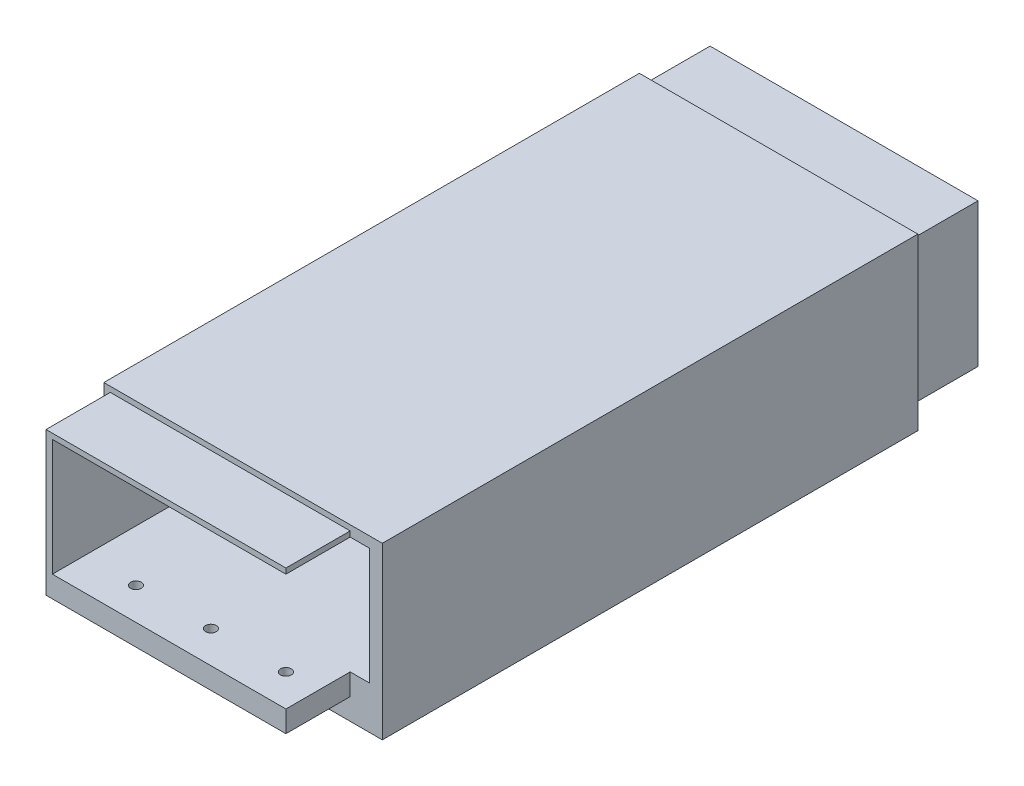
ISO-10303-21;
HEADER;
FILE_DESCRIPTION(('STEP AP214'),'2;1');
FILE_NAME('part.step','',(''),(''),'','','');
FILE_SCHEMA(('AUTOMOTIVE_DESIGN { 1 0 10303 214 1 1 1 1 }'));
ENDSEC;
DATA;
#1=APPLICATION_CONTEXT('core data for automotive mechanical design processes');
#2=APPLICATION_PROTOCOL_DEFINITION('international standard','automotive_design',2000,#1);
#3=PRODUCT_CONTEXT('',#1,'mechanical');
#4=PRODUCT('Part','Part','',(#3));
#5=PRODUCT_RELATED_PRODUCT_CATEGORY('part','',(#4));
#6=PRODUCT_DEFINITION_FORMATION('','',#4);
#7=PRODUCT_DEFINITION_CONTEXT('part definition',#1,'design');
#8=PRODUCT_DEFINITION('design','',#6,#7);
#9=PRODUCT_DEFINITION_SHAPE('','',#8);
#10=(LENGTH_UNIT() NAMED_UNIT(*) SI_UNIT(.MILLI.,.METRE.));
#11=(NAMED_UNIT(*) PLANE_ANGLE_UNIT() SI_UNIT($,.RADIAN.));
#12=(NAMED_UNIT(*) SI_UNIT($,.STERADIAN.) SOLID_ANGLE_UNIT());
#13=UNCERTAINTY_MEASURE_WITH_UNIT(LENGTH_MEASURE(1.E-05),#10,'distance_accuracy_value','');
#14=(GEOMETRIC_REPRESENTATION_CONTEXT(3) GLOBAL_UNCERTAINTY_ASSIGNED_CONTEXT((#13)) GLOBAL_UNIT_ASSIGNED_CONTEXT((#10,
#11,#12)) REPRESENTATION_CONTEXT('',''));
#15=CARTESIAN_POINT('',(0.,0.,0.));
#16=DIRECTION('',(0.,0.,1.));
#17=DIRECTION('',(1.,0.,0.));
#18=AXIS2_PLACEMENT_3D('',#15,#16,#17);
#19=CARTESIAN_POINT('',(0.,0.,1670.00000000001));
#20=DIRECTION('',(0.,0.,-1.));
#21=DIRECTION('',(-1.,0.,0.));
#22=AXIS2_PLACEMENT_3D('',#19,#20,#21);
#23=PLANE('',#22);
#24=DIRECTION('',(0.,1.,0.));
#25=VECTOR('',#24,1.);
#26=CARTESIAN_POINT('',(-7.30239365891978,142.51739571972,1670.00000000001));
#27=LINE('',#26,#25);
#28=CARTESIAN_POINT('',(-7.30239365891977,73.0246653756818,1670.00000000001));
#29=VERTEX_POINT('',#28);
#30=CARTESIAN_POINT('',(-7.30239365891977,83.0246653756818,1670.00000000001));
#31=VERTEX_POINT('',#30);
#32=EDGE_CURVE('E167',#29,#31,#27,.T.);
#33=ORIENTED_EDGE('',*,*,#32,.F.);
#34=DIRECTION('',(1.,0.,0.));
#35=VECTOR('',#34,1.);
#36=CARTESIAN_POINT('',(-119.30239365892,73.0246653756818,1670.00000000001));
#37=LINE('',#36,#35);
#38=CARTESIAN_POINT('',(-119.30239365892,73.0246653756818,1670.00000000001));
#39=VERTEX_POINT('',#38);
#40=EDGE_CURVE('E178',#39,#29,#37,.T.);
#41=ORIENTED_EDGE('',*,*,#40,.F.);
#42=DIRECTION('',(0.,-1.,0.));
#43=VECTOR('',#42,1.);
#44=CARTESIAN_POINT('',(-119.30239365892,140.01739571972,1670.00000000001));
#45=LINE('',#44,#43);
#46=CARTESIAN_POINT('',(-119.30239365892,140.01739571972,1670.00000000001));
#47=VERTEX_POINT('',#46);
#48=EDGE_CURVE('E188',#47,#39,#45,.T.);
#49=ORIENTED_EDGE('',*,*,#48,.F.);
#50=DIRECTION('',(-1.,0.,0.));
#51=VECTOR('',#50,1.);
#52=CARTESIAN_POINT('',(-119.30239365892,140.01739571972,1670.00000000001));
#53=LINE('',#52,#51);
#54=CARTESIAN_POINT('',(-7.30239365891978,140.01739571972,1670.00000000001));
#55=VERTEX_POINT('',#54);
#56=EDGE_CURVE('E60',#55,#47,#53,.T.);
#57=ORIENTED_EDGE('',*,*,#56,.F.);
#58=CARTESIAN_POINT('',(-7.30239365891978,137.51739571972,1670.00000000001));
#59=VERTEX_POINT('',#58);
#60=EDGE_CURVE('E54',#59,#55,#27,.T.);
#61=ORIENTED_EDGE('',*,*,#60,.F.);
#62=DIRECTION('',(1.,0.,0.));
#63=VECTOR('',#62,1.);
#64=CARTESIAN_POINT('',(-116.30239365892,137.51739571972,1670.00000000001));
#65=LINE('',#64,#63);
#66=CARTESIAN_POINT('',(1.6976063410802,137.51739571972,1670.00000000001));
#67=VERTEX_POINT('',#66);
#68=EDGE_CURVE('E407',#59,#67,#65,.T.);
#69=ORIENTED_EDGE('',*,*,#68,.T.);
#70=DIRECTION('',(0.,-1.,0.));
#71=VECTOR('',#70,1.);
#72=CARTESIAN_POINT('',(1.6976063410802,137.51739571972,1670.00000000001));
#73=LINE('',#72,#71);
#74=CARTESIAN_POINT('',(1.69760634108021,83.0246653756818,1670.00000000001));
#75=VERTEX_POINT('',#74);
#76=EDGE_CURVE('E413',#67,#75,#73,.T.);
#77=ORIENTED_EDGE('',*,*,#76,.T.);
#78=DIRECTION('',(-1.,0.,0.));
#79=VECTOR('',#78,1.);
#80=CARTESIAN_POINT('',(-116.30239365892,83.0246653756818,1670.00000000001));
#81=LINE('',#80,#79);
#82=EDGE_CURVE('E181',#75,#31,#81,.T.);
#83=ORIENTED_EDGE('',*,*,#82,.T.);
#84=EDGE_LOOP('',(#33,#41,#49,#57,#61,#69,#77,#83));
#85=FACE_BOUND('',#84,.T.);
#86=DIRECTION('',(1.,0.,0.));
#87=VECTOR('',#86,1.);
#88=CARTESIAN_POINT('',(-122.30239365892,63.0246653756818,1670.00000000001));
#89=LINE('',#88,#87);
#90=CARTESIAN_POINT('',(-122.30239365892,63.0246653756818,1670.00000000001));
#91=VERTEX_POINT('',#90);
#92=CARTESIAN_POINT('',(7.69760634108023,63.0246653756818,1670.00000000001));
#93=VERTEX_POINT('',#92);
#94=EDGE_CURVE('E205',#91,#93,#89,.T.);
#95=ORIENTED_EDGE('',*,*,#94,.T.);
#96=DIRECTION('',(0.,1.,0.));
#97=VECTOR('',#96,1.);
#98=CARTESIAN_POINT('',(7.69760634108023,63.0246653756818,1670.00000000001));
#99=LINE('',#98,#97);
#100=CARTESIAN_POINT('',(7.69760634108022,142.51739571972,1670.00000000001));
#101=VERTEX_POINT('',#100);
#102=EDGE_CURVE('E208',#93,#101,#99,.T.);
#103=ORIENTED_EDGE('',*,*,#102,.T.);
#104=DIRECTION('',(-1.,0.,0.));
#105=VECTOR('',#104,1.);
#106=CARTESIAN_POINT('',(-122.30239365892,142.51739571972,1670.00000000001));
#107=LINE('',#106,#105);
#108=CARTESIAN_POINT('',(-122.30239365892,142.51739571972,1670.00000000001));
#109=VERTEX_POINT('',#108);
#110=EDGE_CURVE('E210',#101,#109,#107,.T.);
#111=ORIENTED_EDGE('',*,*,#110,.T.);
#112=DIRECTION('',(0.,-1.,0.));
#113=VECTOR('',#112,1.);
#114=CARTESIAN_POINT('',(-122.30239365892,63.0246653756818,1670.00000000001));
#115=LINE('',#114,#113);
#116=EDGE_CURVE('E202',#109,#91,#115,.T.);
#117=ORIENTED_EDGE('',*,*,#116,.T.);
#118=EDGE_LOOP('',(#95,#103,#111,#117));
#119=FACE_BOUND('',#118,.T.);
#120=ADVANCED_FACE('F39',(#85,#119),#23,.F.);
#121=CARTESIAN_POINT('',(-119.30239365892,140.01739571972,1561.88680099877));
#122=DIRECTION('',(0.,-1.,0.));
#123=DIRECTION('',(0.,0.,-1.));
#124=AXIS2_PLACEMENT_3D('',#121,#122,#123);
#125=PLANE('',#124);
#126=DIRECTION('',(-1.,0.,0.));
#127=VECTOR('',#126,1.);
#128=CARTESIAN_POINT('',(-119.30239365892,140.01739571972,1420.00000000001));
#129=LINE('',#128,#127);
#130=CARTESIAN_POINT('',(5.77293715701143,140.01739571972,1420.00000000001));
#131=VERTEX_POINT('',#130);
#132=CARTESIAN_POINT('',(-119.30239365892,140.01739571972,1420.00000000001));
#133=VERTEX_POINT('',#132);
#134=EDGE_CURVE('E231',#131,#133,#129,.T.);
#135=ORIENTED_EDGE('',*,*,#134,.F.);
#136=DIRECTION('',(0.,0.,-1.));
#137=VECTOR('',#136,1.);
#138=CARTESIAN_POINT('',(5.77293715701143,140.01739571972,1561.88680099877));
#139=LINE('',#138,#137);
#140=CARTESIAN_POINT('',(5.77293715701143,140.01739571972,1390.00000000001));
#141=VERTEX_POINT('',#140);
#142=EDGE_CURVE('E277',#131,#141,#139,.T.);
#143=ORIENTED_EDGE('',*,*,#142,.T.);
#144=DIRECTION('',(-1.,0.,0.));
#145=VECTOR('',#144,1.);
#146=CARTESIAN_POINT('',(-119.30239365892,140.01739571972,1390.00000000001));
#147=LINE('',#146,#145);
#148=CARTESIAN_POINT('',(-119.30239365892,140.01739571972,1390.00000000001));
#149=VERTEX_POINT('',#148);
#150=EDGE_CURVE('E272',#141,#149,#147,.T.);
#151=ORIENTED_EDGE('',*,*,#150,.T.);
#152=DIRECTION('',(0.,0.,-1.));
#153=VECTOR('',#152,1.);
#154=CARTESIAN_POINT('',(-119.30239365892,140.01739571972,1561.88680099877));
#155=LINE('',#154,#153);
#156=EDGE_CURVE('E275',#133,#149,#155,.T.);
#157=ORIENTED_EDGE('',*,*,#156,.F.);
#158=EDGE_LOOP('',(#135,#143,#151,#157));
#159=FACE_BOUND('',#158,.T.);
#160=ADVANCED_FACE('F294',(#159),#125,.F.);
#161=CARTESIAN_POINT('',(5.77293715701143,140.01739571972,1561.88680099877));
#162=DIRECTION('',(-1.,0.,0.));
#163=DIRECTION('',(0.,-1.,0.));
#164=AXIS2_PLACEMENT_3D('',#161,#162,#163);
#165=PLANE('',#164);
#166=DIRECTION('',(0.,1.,0.));
#167=VECTOR('',#166,1.);
#168=CARTESIAN_POINT('',(5.77293715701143,140.01739571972,1420.00000000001));
#169=LINE('',#168,#167);
#170=CARTESIAN_POINT('',(5.77293715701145,73.0246653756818,1420.00000000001));
#171=VERTEX_POINT('',#170);
#172=EDGE_CURVE('E234',#171,#131,#169,.T.);
#173=ORIENTED_EDGE('',*,*,#172,.F.);
#174=DIRECTION('',(0.,0.,-1.));
#175=VECTOR('',#174,1.);
#176=CARTESIAN_POINT('',(5.77293715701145,73.0246653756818,1561.88680099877));
#177=LINE('',#176,#175);
#178=CARTESIAN_POINT('',(5.77293715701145,73.0246653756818,1390.00000000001));
#179=VERTEX_POINT('',#178);
#180=EDGE_CURVE('E279',#171,#179,#177,.T.);
#181=ORIENTED_EDGE('',*,*,#180,.T.);
#182=DIRECTION('',(0.,1.,0.));
#183=VECTOR('',#182,1.);
#184=CARTESIAN_POINT('',(5.77293715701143,140.01739571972,1390.00000000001));
#185=LINE('',#184,#183);
#186=EDGE_CURVE('E269',#179,#141,#185,.T.);
#187=ORIENTED_EDGE('',*,*,#186,.T.);
#188=ORIENTED_EDGE('',*,*,#142,.F.);
#189=EDGE_LOOP('',(#173,#181,#187,#188));
#190=FACE_BOUND('',#189,.T.);
#191=ADVANCED_FACE('F297',(#190),#165,.F.);
#192=CARTESIAN_POINT('',(-119.30239365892,73.0246653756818,1561.88680099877));
#193=DIRECTION('',(0.,1.,0.));
#194=DIRECTION('',(0.,0.,1.));
#195=AXIS2_PLACEMENT_3D('',#192,#193,#194);
#196=PLANE('',#195);
#197=CARTESIAN_POINT('',(-92.3023936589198,73.0246653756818,1405.00000000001));
#198=DIRECTION('',(0.,-1.,0.));
#199=DIRECTION('',(0.,0.,-1.));
#200=AXIS2_PLACEMENT_3D('',#197,#198,#199);
#201=CIRCLE('',#200,2.49999999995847);
#202=CARTESIAN_POINT('',(-92.3023936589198,73.0246653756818,1402.50000000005));
#203=VERTEX_POINT('',#202);
#204=EDGE_CURVE('E370',#203,#203,#201,.T.);
#205=ORIENTED_EDGE('',*,*,#204,.F.);
#206=EDGE_LOOP('',(#205));
#207=FACE_BOUND('',#206,.T.);
#208=CARTESIAN_POINT('',(-57.3023936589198,73.0246653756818,1405.00000000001));
#209=DIRECTION('',(0.,-1.,0.));
#210=DIRECTION('',(0.,0.,-1.));
#211=AXIS2_PLACEMENT_3D('',#208,#209,#210);
#212=CIRCLE('',#211,2.49999999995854);
#213=CARTESIAN_POINT('',(-57.3023936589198,73.0246653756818,1402.50000000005));
#214=VERTEX_POINT('',#213);
#215=EDGE_CURVE('E374',#214,#214,#212,.T.);
#216=ORIENTED_EDGE('',*,*,#215,.F.);
#217=EDGE_LOOP('',(#216));
#218=FACE_BOUND('',#217,.T.);
#219=CARTESIAN_POINT('',(-22.3023936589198,73.0246653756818,1405.00000000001));
#220=DIRECTION('',(0.,-1.,0.));
#221=DIRECTION('',(0.,0.,-1.));
#222=AXIS2_PLACEMENT_3D('',#219,#220,#221);
#223=CIRCLE('',#222,2.49999999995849);
#224=CARTESIAN_POINT('',(-22.3023936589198,73.0246653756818,1402.50000000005));
#225=VERTEX_POINT('',#224);
#226=EDGE_CURVE('E377',#225,#225,#223,.T.);
#227=ORIENTED_EDGE('',*,*,#226,.F.);
#228=EDGE_LOOP('',(#227));
#229=FACE_BOUND('',#228,.T.);
#230=DIRECTION('',(1.,0.,0.));
#231=VECTOR('',#230,1.);
#232=CARTESIAN_POINT('',(-119.30239365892,73.0246653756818,1420.00000000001));
#233=LINE('',#232,#231);
#234=CARTESIAN_POINT('',(-119.30239365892,73.0246653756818,1420.00000000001));
#235=VERTEX_POINT('',#234);
#236=EDGE_CURVE('E237',#235,#171,#233,.T.);
#237=ORIENTED_EDGE('',*,*,#236,.F.);
#238=DIRECTION('',(0.,0.,-1.));
#239=VECTOR('',#238,1.);
#240=CARTESIAN_POINT('',(-119.30239365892,73.0246653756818,1561.88680099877));
#241=LINE('',#240,#239);
#242=CARTESIAN_POINT('',(-119.30239365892,73.0246653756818,1390.00000000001));
#243=VERTEX_POINT('',#242);
#244=EDGE_CURVE('E47',#235,#243,#241,.T.);
#245=ORIENTED_EDGE('',*,*,#244,.T.);
#246=DIRECTION('',(1.,0.,0.));
#247=VECTOR('',#246,1.);
#248=CARTESIAN_POINT('',(-119.30239365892,73.0246653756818,1390.00000000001));
#249=LINE('',#248,#247);
#250=EDGE_CURVE('E266',#243,#179,#249,.T.);
#251=ORIENTED_EDGE('',*,*,#250,.T.);
#252=ORIENTED_EDGE('',*,*,#180,.F.);
#253=EDGE_LOOP('',(#237,#245,#251,#252));
#254=FACE_BOUND('',#253,.T.);
#255=ADVANCED_FACE('F283',(#207,#218,#229,#254),#196,.F.);
#256=CARTESIAN_POINT('',(-119.30239365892,140.01739571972,1561.88680099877));
#257=DIRECTION('',(1.,0.,0.));
#258=DIRECTION('',(0.,1.,0.));
#259=AXIS2_PLACEMENT_3D('',#256,#257,#258);
#260=PLANE('',#259);
#261=DIRECTION('',(0.,-1.,0.));
#262=VECTOR('',#261,1.);
#263=CARTESIAN_POINT('',(-119.30239365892,140.01739571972,1420.00000000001));
#264=LINE('',#263,#262);
#265=EDGE_CURVE('E240',#133,#235,#264,.T.);
#266=ORIENTED_EDGE('',*,*,#265,.F.);
#267=ORIENTED_EDGE('',*,*,#156,.T.);
#268=DIRECTION('',(0.,-1.,0.));
#269=VECTOR('',#268,1.);
#270=CARTESIAN_POINT('',(-119.30239365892,140.01739571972,1390.00000000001));
#271=LINE('',#270,#269);
#272=EDGE_CURVE('E263',#149,#243,#271,.T.);
#273=ORIENTED_EDGE('',*,*,#272,.T.);
#274=ORIENTED_EDGE('',*,*,#244,.F.);
#275=EDGE_LOOP('',(#266,#267,#273,#274));
#276=FACE_BOUND('',#275,.T.);
#277=ADVANCED_FACE('F41',(#276),#260,.F.);
#278=CARTESIAN_POINT('',(0.,0.,1390.00000000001));
#279=DIRECTION('',(0.,0.,1.));
#280=DIRECTION('',(1.,0.,0.));
#281=AXIS2_PLACEMENT_3D('',#278,#279,#280);
#282=PLANE('',#281);
#283=ORIENTED_EDGE('',*,*,#272,.F.);
#284=ORIENTED_EDGE('',*,*,#150,.F.);
#285=ORIENTED_EDGE('',*,*,#186,.F.);
#286=ORIENTED_EDGE('',*,*,#250,.F.);
#287=EDGE_LOOP('',(#283,#284,#285,#286));
#288=FACE_BOUND('',#287,.T.);
#289=DIRECTION('',(0.,-1.,0.));
#290=VECTOR('',#289,1.);
#291=CARTESIAN_POINT('',(-116.30239365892,137.51739571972,1390.00000000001));
#292=LINE('',#291,#290);
#293=CARTESIAN_POINT('',(-116.30239365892,137.51739571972,1390.00000000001));
#294=VERTEX_POINT('',#293);
#295=CARTESIAN_POINT('',(-116.30239365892,83.0246653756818,1390.00000000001));
#296=VERTEX_POINT('',#295);
#297=EDGE_CURVE('E243',#294,#296,#292,.T.);
#298=ORIENTED_EDGE('',*,*,#297,.T.);
#299=DIRECTION('',(1.,0.,0.));
#300=VECTOR('',#299,1.);
#301=CARTESIAN_POINT('',(-116.30239365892,83.0246653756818,1390.00000000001));
#302=LINE('',#301,#300);
#303=CARTESIAN_POINT('',(1.69760634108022,83.0246653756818,1390.00000000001));
#304=VERTEX_POINT('',#303);
#305=EDGE_CURVE('E246',#296,#304,#302,.T.);
#306=ORIENTED_EDGE('',*,*,#305,.T.);
#307=DIRECTION('',(0.,1.,0.));
#308=VECTOR('',#307,1.);
#309=CARTESIAN_POINT('',(1.6976063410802,137.51739571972,1390.00000000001));
#310=LINE('',#309,#308);
#311=CARTESIAN_POINT('',(1.6976063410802,137.51739571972,1390.00000000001));
#312=VERTEX_POINT('',#311);
#313=EDGE_CURVE('E249',#304,#312,#310,.T.);
#314=ORIENTED_EDGE('',*,*,#313,.T.);
#315=DIRECTION('',(-1.,0.,0.));
#316=VECTOR('',#315,1.);
#317=CARTESIAN_POINT('',(-116.30239365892,137.51739571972,1390.00000000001));
#318=LINE('',#317,#316);
#319=EDGE_CURVE('E252',#312,#294,#318,.T.);
#320=ORIENTED_EDGE('',*,*,#319,.T.);
#321=EDGE_LOOP('',(#298,#306,#314,#320));
#322=FACE_BOUND('',#321,.T.);
#323=ADVANCED_FACE('F290',(#288,#322),#282,.F.);
#324=CARTESIAN_POINT('',(-116.30239365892,137.51739571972,1561.88680099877));
#325=DIRECTION('',(0.,-1.,0.));
#326=DIRECTION('',(0.,0.,-1.));
#327=AXIS2_PLACEMENT_3D('',#324,#325,#326);
#328=PLANE('',#327);
#329=ORIENTED_EDGE('',*,*,#68,.F.);
#330=DIRECTION('',(0.,0.,-1.));
#331=VECTOR('',#330,1.);
#332=CARTESIAN_POINT('',(-7.30239365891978,137.51739571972,1561.88680099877));
#333=LINE('',#332,#331);
#334=CARTESIAN_POINT('',(-7.30239365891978,137.51739571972,1700.00000000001));
#335=VERTEX_POINT('',#334);
#336=EDGE_CURVE('E174',#335,#59,#333,.T.);
#337=ORIENTED_EDGE('',*,*,#336,.F.);
#338=DIRECTION('',(-1.,0.,0.));
#339=VECTOR('',#338,1.);
#340=CARTESIAN_POINT('',(-116.30239365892,137.51739571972,1700.00000000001));
#341=LINE('',#340,#339);
#342=CARTESIAN_POINT('',(-116.30239365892,137.51739571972,1700.00000000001));
#343=VERTEX_POINT('',#342);
#344=EDGE_CURVE('E192',#335,#343,#341,.T.);
#345=ORIENTED_EDGE('',*,*,#344,.T.);
#346=DIRECTION('',(0.,0.,-1.));
#347=VECTOR('',#346,1.);
#348=CARTESIAN_POINT('',(-116.30239365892,137.51739571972,1561.88680099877));
#349=LINE('',#348,#347);
#350=EDGE_CURVE('E255',#343,#294,#349,.T.);
#351=ORIENTED_EDGE('',*,*,#350,.T.);
#352=ORIENTED_EDGE('',*,*,#319,.F.);
#353=DIRECTION('',(0.,0.,-1.));
#354=VECTOR('',#353,1.);
#355=CARTESIAN_POINT('',(1.6976063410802,137.51739571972,1561.88680099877));
#356=LINE('',#355,#354);
#357=EDGE_CURVE('E257',#67,#312,#356,.T.);
#358=ORIENTED_EDGE('',*,*,#357,.F.);
#359=EDGE_LOOP('',(#329,#337,#345,#351,#352,#358));
#360=FACE_BOUND('',#359,.T.);
#361=ADVANCED_FACE('F343',(#360),#328,.T.);
#362=CARTESIAN_POINT('',(1.6976063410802,137.51739571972,1561.88680099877));
#363=DIRECTION('',(-1.,0.,0.));
#364=DIRECTION('',(0.,-1.,0.));
#365=AXIS2_PLACEMENT_3D('',#362,#363,#364);
#366=PLANE('',#365);
#367=ORIENTED_EDGE('',*,*,#76,.F.);
#368=ORIENTED_EDGE('',*,*,#357,.T.);
#369=ORIENTED_EDGE('',*,*,#313,.F.);
#370=DIRECTION('',(0.,0.,-1.));
#371=VECTOR('',#370,1.);
#372=CARTESIAN_POINT('',(1.69760634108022,83.0246653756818,1561.88680099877));
#373=LINE('',#372,#371);
#374=EDGE_CURVE('E259',#75,#304,#373,.T.);
#375=ORIENTED_EDGE('',*,*,#374,.F.);
#376=EDGE_LOOP('',(#367,#368,#369,#375));
#377=FACE_BOUND('',#376,.T.);
#378=ADVANCED_FACE('F345',(#377),#366,.T.);
#379=CARTESIAN_POINT('',(-116.30239365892,83.0246653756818,1561.88680099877));
#380=DIRECTION('',(0.,1.,0.));
#381=DIRECTION('',(0.,0.,1.));
#382=AXIS2_PLACEMENT_3D('',#379,#380,#381);
#383=PLANE('',#382);
#384=ORIENTED_EDGE('',*,*,#82,.F.);
#385=ORIENTED_EDGE('',*,*,#374,.T.);
#386=ORIENTED_EDGE('',*,*,#305,.F.);
#387=DIRECTION('',(0.,0.,-1.));
#388=VECTOR('',#387,1.);
#389=CARTESIAN_POINT('',(-116.30239365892,83.0246653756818,1561.88680099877));
#390=LINE('',#389,#388);
#391=CARTESIAN_POINT('',(-116.30239365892,83.0246653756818,1700.00000000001));
#392=VERTEX_POINT('',#391);
#393=EDGE_CURVE('E261',#392,#296,#390,.T.);
#394=ORIENTED_EDGE('',*,*,#393,.F.);
#395=DIRECTION('',(1.,0.,0.));
#396=VECTOR('',#395,1.);
#397=CARTESIAN_POINT('',(-116.30239365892,83.0246653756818,1700.00000000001));
#398=LINE('',#397,#396);
#399=CARTESIAN_POINT('',(-7.30239365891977,83.0246653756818,1700.00000000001));
#400=VERTEX_POINT('',#399);
#401=EDGE_CURVE('E392',#392,#400,#398,.T.);
#402=ORIENTED_EDGE('',*,*,#401,.T.);
#403=DIRECTION('',(0.,0.,1.));
#404=VECTOR('',#403,1.);
#405=CARTESIAN_POINT('',(-7.30239365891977,83.0246653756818,1561.88680099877));
#406=LINE('',#405,#404);
#407=EDGE_CURVE('E489',#31,#400,#406,.T.);
#408=ORIENTED_EDGE('',*,*,#407,.F.);
#409=EDGE_LOOP('',(#384,#385,#386,#394,#402,#408));
#410=FACE_BOUND('',#409,.T.);
#411=CARTESIAN_POINT('',(-92.3023936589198,83.0246653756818,1685.00000000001));
#412=DIRECTION('',(0.,1.,0.));
#413=DIRECTION('',(0.,0.,1.));
#414=AXIS2_PLACEMENT_3D('',#411,#412,#413);
#415=CIRCLE('',#414,2.49999999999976);
#416=CARTESIAN_POINT('',(-92.3023936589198,83.0246653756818,1687.50000000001));
#417=VERTEX_POINT('',#416);
#418=EDGE_CURVE('E385',#417,#417,#415,.F.);
#419=ORIENTED_EDGE('',*,*,#418,.T.);
#420=EDGE_LOOP('',(#419));
#421=FACE_BOUND('',#420,.T.);
#422=CARTESIAN_POINT('',(-57.3023936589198,83.0246653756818,1685.00000000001));
#423=DIRECTION('',(0.,1.,0.));
#424=DIRECTION('',(0.,0.,1.));
#425=AXIS2_PLACEMENT_3D('',#422,#423,#424);
#426=CIRCLE('',#425,2.50000000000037);
#427=CARTESIAN_POINT('',(-57.3023936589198,83.0246653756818,1687.50000000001));
#428=VERTEX_POINT('',#427);
#429=EDGE_CURVE('E422',#428,#428,#426,.F.);
#430=ORIENTED_EDGE('',*,*,#429,.T.);
#431=EDGE_LOOP('',(#430));
#432=FACE_BOUND('',#431,.T.);
#433=CARTESIAN_POINT('',(-22.3023936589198,83.0246653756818,1685.00000000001));
#434=DIRECTION('',(0.,1.,0.));
#435=DIRECTION('',(0.,0.,1.));
#436=AXIS2_PLACEMENT_3D('',#433,#434,#435);
#437=CIRCLE('',#436,2.49999999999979);
#438=CARTESIAN_POINT('',(-22.3023936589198,83.0246653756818,1687.50000000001));
#439=VERTEX_POINT('',#438);
#440=EDGE_CURVE('E416',#439,#439,#437,.F.);
#441=ORIENTED_EDGE('',*,*,#440,.T.);
#442=EDGE_LOOP('',(#441));
#443=FACE_BOUND('',#442,.T.);
#444=CARTESIAN_POINT('',(-92.3023936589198,83.0246653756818,1405.00000000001));
#445=DIRECTION('',(0.,1.,0.));
#446=DIRECTION('',(0.,0.,1.));
#447=AXIS2_PLACEMENT_3D('',#444,#445,#446);
#448=CIRCLE('',#447,2.49999999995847);
#449=CARTESIAN_POINT('',(-92.3023936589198,83.0246653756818,1407.49999999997));
#450=VERTEX_POINT('',#449);
#451=EDGE_CURVE('E432',#450,#450,#448,.F.);
#452=ORIENTED_EDGE('',*,*,#451,.T.);
#453=EDGE_LOOP('',(#452));
#454=FACE_BOUND('',#453,.T.);
#455=CARTESIAN_POINT('',(-57.3023936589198,83.0246653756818,1405.00000000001));
#456=DIRECTION('',(0.,1.,0.));
#457=DIRECTION('',(0.,0.,1.));
#458=AXIS2_PLACEMENT_3D('',#455,#456,#457);
#459=CIRCLE('',#458,2.49999999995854);
#460=CARTESIAN_POINT('',(-57.3023936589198,83.0246653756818,1407.49999999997));
#461=VERTEX_POINT('',#460);
#462=EDGE_CURVE('E435',#461,#461,#459,.F.);
#463=ORIENTED_EDGE('',*,*,#462,.T.);
#464=EDGE_LOOP('',(#463));
#465=FACE_BOUND('',#464,.T.);
#466=CARTESIAN_POINT('',(-22.3023936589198,83.0246653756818,1405.00000000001));
#467=DIRECTION('',(0.,1.,0.));
#468=DIRECTION('',(0.,0.,1.));
#469=AXIS2_PLACEMENT_3D('',#466,#467,#468);
#470=CIRCLE('',#469,2.49999999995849);
#471=CARTESIAN_POINT('',(-22.3023936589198,83.0246653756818,1407.49999999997));
#472=VERTEX_POINT('',#471);
#473=EDGE_CURVE('E379',#472,#472,#470,.F.);
#474=ORIENTED_EDGE('',*,*,#473,.T.);
#475=EDGE_LOOP('',(#474));
#476=FACE_BOUND('',#475,.T.);
#477=ADVANCED_FACE('F349',(#410,#421,#432,#443,#454,#465,#476),#383,.T.);
#478=CARTESIAN_POINT('',(-116.30239365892,137.51739571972,1561.88680099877));
#479=DIRECTION('',(1.,0.,0.));
#480=DIRECTION('',(0.,0.,-1.));
#481=AXIS2_PLACEMENT_3D('',#478,#479,#480);
#482=PLANE('',#481);
#483=ORIENTED_EDGE('',*,*,#350,.F.);
#484=DIRECTION('',(0.,-1.,0.));
#485=VECTOR('',#484,1.);
#486=CARTESIAN_POINT('',(-116.30239365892,137.51739571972,1700.00000000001));
#487=LINE('',#486,#485);
#488=EDGE_CURVE('E389',#343,#392,#487,.T.);
#489=ORIENTED_EDGE('',*,*,#488,.T.);
#490=ORIENTED_EDGE('',*,*,#393,.T.);
#491=ORIENTED_EDGE('',*,*,#297,.F.);
#492=EDGE_LOOP('',(#483,#489,#490,#491));
#493=FACE_BOUND('',#492,.T.);
#494=ADVANCED_FACE('F303',(#493),#482,.T.);
#495=CARTESIAN_POINT('',(0.,0.,1420.00000000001));
#496=DIRECTION('',(0.,0.,-1.));
#497=DIRECTION('',(-1.,0.,0.));
#498=AXIS2_PLACEMENT_3D('',#495,#496,#497);
#499=PLANE('',#498);
#500=ORIENTED_EDGE('',*,*,#172,.T.);
#501=ORIENTED_EDGE('',*,*,#134,.T.);
#502=ORIENTED_EDGE('',*,*,#265,.T.);
#503=ORIENTED_EDGE('',*,*,#236,.T.);
#504=EDGE_LOOP('',(#500,#501,#502,#503));
#505=FACE_BOUND('',#504,.T.);
#506=DIRECTION('',(0.,-1.,0.));
#507=VECTOR('',#506,1.);
#508=CARTESIAN_POINT('',(-122.30239365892,63.0246653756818,1420.00000000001));
#509=LINE('',#508,#507);
#510=CARTESIAN_POINT('',(-122.30239365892,142.51739571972,1420.00000000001));
#511=VERTEX_POINT('',#510);
#512=CARTESIAN_POINT('',(-122.30239365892,63.0246653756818,1420.00000000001));
#513=VERTEX_POINT('',#512);
#514=EDGE_CURVE('E201',#511,#513,#509,.T.);
#515=ORIENTED_EDGE('',*,*,#514,.F.);
#516=DIRECTION('',(-1.,0.,0.));
#517=VECTOR('',#516,1.);
#518=CARTESIAN_POINT('',(-122.30239365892,142.51739571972,1420.00000000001));
#519=LINE('',#518,#517);
#520=CARTESIAN_POINT('',(7.69760634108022,142.51739571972,1420.00000000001));
#521=VERTEX_POINT('',#520);
#522=EDGE_CURVE('E206',#521,#511,#519,.T.);
#523=ORIENTED_EDGE('',*,*,#522,.F.);
#524=DIRECTION('',(0.,1.,0.));
#525=VECTOR('',#524,1.);
#526=CARTESIAN_POINT('',(7.69760634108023,63.0246653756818,1420.00000000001));
#527=LINE('',#526,#525);
#528=CARTESIAN_POINT('',(7.69760634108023,63.0246653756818,1420.00000000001));
#529=VERTEX_POINT('',#528);
#530=EDGE_CURVE('E217',#529,#521,#527,.T.);
#531=ORIENTED_EDGE('',*,*,#530,.F.);
#532=DIRECTION('',(1.,0.,0.));
#533=VECTOR('',#532,1.);
#534=CARTESIAN_POINT('',(-122.30239365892,63.0246653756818,1420.00000000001));
#535=LINE('',#534,#533);
#536=EDGE_CURVE('E215',#513,#529,#535,.T.);
#537=ORIENTED_EDGE('',*,*,#536,.F.);
#538=EDGE_LOOP('',(#515,#523,#531,#537));
#539=FACE_BOUND('',#538,.T.);
#540=ADVANCED_FACE('F299',(#505,#539),#499,.T.);
#541=CARTESIAN_POINT('',(-122.30239365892,142.51739571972,1670.00000000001));
#542=DIRECTION('',(0.,-1.,0.));
#543=DIRECTION('',(0.,0.,-1.));
#544=AXIS2_PLACEMENT_3D('',#541,#542,#543);
#545=PLANE('',#544);
#546=ORIENTED_EDGE('',*,*,#522,.T.);
#547=DIRECTION('',(0.,0.,-1.));
#548=VECTOR('',#547,1.);
#549=CARTESIAN_POINT('',(-122.30239365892,142.51739571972,1670.00000000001));
#550=LINE('',#549,#548);
#551=EDGE_CURVE('E212',#109,#511,#550,.T.);
#552=ORIENTED_EDGE('',*,*,#551,.F.);
#553=ORIENTED_EDGE('',*,*,#110,.F.);
#554=DIRECTION('',(0.,0.,-1.));
#555=VECTOR('',#554,1.);
#556=CARTESIAN_POINT('',(7.69760634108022,142.51739571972,1670.00000000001));
#557=LINE('',#556,#555);
#558=EDGE_CURVE('E222',#101,#521,#557,.T.);
#559=ORIENTED_EDGE('',*,*,#558,.T.);
#560=EDGE_LOOP('',(#546,#552,#553,#559));
#561=FACE_BOUND('',#560,.T.);
#562=ADVANCED_FACE('F302',(#561),#545,.F.);
#563=CARTESIAN_POINT('',(7.69760634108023,63.0246653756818,1670.00000000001));
#564=DIRECTION('',(-1.,0.,0.));
#565=DIRECTION('',(0.,-1.,0.));
#566=AXIS2_PLACEMENT_3D('',#563,#564,#565);
#567=PLANE('',#566);
#568=ORIENTED_EDGE('',*,*,#530,.T.);
#569=ORIENTED_EDGE('',*,*,#558,.F.);
#570=ORIENTED_EDGE('',*,*,#102,.F.);
#571=DIRECTION('',(0.,0.,-1.));
#572=VECTOR('',#571,1.);
#573=CARTESIAN_POINT('',(7.69760634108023,63.0246653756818,1670.00000000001));
#574=LINE('',#573,#572);
#575=EDGE_CURVE('E225',#93,#529,#574,.T.);
#576=ORIENTED_EDGE('',*,*,#575,.T.);
#577=EDGE_LOOP('',(#568,#569,#570,#576));
#578=FACE_BOUND('',#577,.T.);
#579=ADVANCED_FACE('F318',(#578),#567,.F.);
#580=CARTESIAN_POINT('',(-122.30239365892,63.0246653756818,1670.00000000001));
#581=DIRECTION('',(0.,1.,0.));
#582=DIRECTION('',(0.,0.,1.));
#583=AXIS2_PLACEMENT_3D('',#580,#581,#582);
#584=PLANE('',#583);
#585=ORIENTED_EDGE('',*,*,#536,.T.);
#586=ORIENTED_EDGE('',*,*,#575,.F.);
#587=ORIENTED_EDGE('',*,*,#94,.F.);
#588=DIRECTION('',(0.,0.,-1.));
#589=VECTOR('',#588,1.);
#590=CARTESIAN_POINT('',(-122.30239365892,63.0246653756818,1670.00000000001));
#591=LINE('',#590,#589);
#592=EDGE_CURVE('E228',#91,#513,#591,.T.);
#593=ORIENTED_EDGE('',*,*,#592,.T.);
#594=EDGE_LOOP('',(#585,#586,#587,#593));
#595=FACE_BOUND('',#594,.T.);
#596=ADVANCED_FACE('F321',(#595),#584,.F.);
#597=CARTESIAN_POINT('',(-122.30239365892,63.0246653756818,1670.00000000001));
#598=DIRECTION('',(1.,0.,0.));
#599=DIRECTION('',(0.,1.,0.));
#600=AXIS2_PLACEMENT_3D('',#597,#598,#599);
#601=PLANE('',#600);
#602=ORIENTED_EDGE('',*,*,#514,.T.);
#603=ORIENTED_EDGE('',*,*,#592,.F.);
#604=ORIENTED_EDGE('',*,*,#116,.F.);
#605=ORIENTED_EDGE('',*,*,#551,.T.);
#606=EDGE_LOOP('',(#602,#603,#604,#605));
#607=FACE_BOUND('',#606,.T.);
#608=ADVANCED_FACE('F310',(#607),#601,.F.);
#609=CARTESIAN_POINT('',(0.,0.,1700.00000000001));
#610=DIRECTION('',(0.,0.,1.));
#611=DIRECTION('',(1.,0.,0.));
#612=AXIS2_PLACEMENT_3D('',#609,#610,#611);
#613=PLANE('',#612);
#614=DIRECTION('',(0.,-1.,0.));
#615=VECTOR('',#614,1.);
#616=CARTESIAN_POINT('',(-7.30239365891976,0.,1700.00000000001));
#617=LINE('',#616,#615);
#618=CARTESIAN_POINT('',(-7.30239365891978,140.01739571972,1700.00000000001));
#619=VERTEX_POINT('',#618);
#620=EDGE_CURVE('E182',#619,#335,#617,.T.);
#621=ORIENTED_EDGE('',*,*,#620,.F.);
#622=DIRECTION('',(-1.,0.,0.));
#623=VECTOR('',#622,1.);
#624=CARTESIAN_POINT('',(-119.30239365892,140.01739571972,1700.00000000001));
#625=LINE('',#624,#623);
#626=CARTESIAN_POINT('',(-119.30239365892,140.01739571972,1700.00000000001));
#627=VERTEX_POINT('',#626);
#628=EDGE_CURVE('E199',#619,#627,#625,.T.);
#629=ORIENTED_EDGE('',*,*,#628,.T.);
#630=DIRECTION('',(0.,-1.,0.));
#631=VECTOR('',#630,1.);
#632=CARTESIAN_POINT('',(-119.30239365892,140.01739571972,1700.00000000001));
#633=LINE('',#632,#631);
#634=CARTESIAN_POINT('',(-119.30239365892,73.0246653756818,1700.00000000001));
#635=VERTEX_POINT('',#634);
#636=EDGE_CURVE('E190',#627,#635,#633,.T.);
#637=ORIENTED_EDGE('',*,*,#636,.T.);
#638=DIRECTION('',(1.,0.,0.));
#639=VECTOR('',#638,1.);
#640=CARTESIAN_POINT('',(-119.30239365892,73.0246653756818,1700.00000000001));
#641=LINE('',#640,#639);
#642=CARTESIAN_POINT('',(-7.30239365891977,73.0246653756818,1700.00000000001));
#643=VERTEX_POINT('',#642);
#644=EDGE_CURVE('E398',#635,#643,#641,.T.);
#645=ORIENTED_EDGE('',*,*,#644,.T.);
#646=EDGE_CURVE('E170',#400,#643,#617,.T.);
#647=ORIENTED_EDGE('',*,*,#646,.F.);
#648=ORIENTED_EDGE('',*,*,#401,.F.);
#649=ORIENTED_EDGE('',*,*,#488,.F.);
#650=ORIENTED_EDGE('',*,*,#344,.F.);
#651=EDGE_LOOP('',(#621,#629,#637,#645,#647,#648,#649,#650));
#652=FACE_BOUND('',#651,.T.);
#653=ADVANCED_FACE('F342',(#652),#613,.T.);
#654=CARTESIAN_POINT('',(-119.30239365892,140.01739571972,1700.00000000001));
#655=DIRECTION('',(1.,0.,0.));
#656=DIRECTION('',(0.,1.,0.));
#657=AXIS2_PLACEMENT_3D('',#654,#655,#656);
#658=PLANE('',#657);
#659=ORIENTED_EDGE('',*,*,#48,.T.);
#660=DIRECTION('',(0.,0.,-1.));
#661=VECTOR('',#660,1.);
#662=CARTESIAN_POINT('',(-119.30239365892,73.0246653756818,1700.00000000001));
#663=LINE('',#662,#661);
#664=EDGE_CURVE('E186',#635,#39,#663,.T.);
#665=ORIENTED_EDGE('',*,*,#664,.F.);
#666=ORIENTED_EDGE('',*,*,#636,.F.);
#667=DIRECTION('',(0.,0.,-1.));
#668=VECTOR('',#667,1.);
#669=CARTESIAN_POINT('',(-119.30239365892,140.01739571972,1700.00000000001));
#670=LINE('',#669,#668);
#671=EDGE_CURVE('E196',#627,#47,#670,.T.);
#672=ORIENTED_EDGE('',*,*,#671,.T.);
#673=EDGE_LOOP('',(#659,#665,#666,#672));
#674=FACE_BOUND('',#673,.T.);
#675=ADVANCED_FACE('F331',(#674),#658,.F.);
#676=CARTESIAN_POINT('',(-119.30239365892,73.0246653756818,1700.00000000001));
#677=DIRECTION('',(0.,1.,0.));
#678=DIRECTION('',(0.,0.,1.));
#679=AXIS2_PLACEMENT_3D('',#676,#677,#678);
#680=PLANE('',#679);
#681=CARTESIAN_POINT('',(-92.3023936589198,73.0246653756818,1685.00000000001));
#682=DIRECTION('',(0.,-1.,0.));
#683=DIRECTION('',(0.,0.,-1.));
#684=AXIS2_PLACEMENT_3D('',#681,#682,#683);
#685=CIRCLE('',#684,2.49999999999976);
#686=CARTESIAN_POINT('',(-92.3023936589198,73.0246653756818,1682.50000000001));
#687=VERTEX_POINT('',#686);
#688=EDGE_CURVE('E380',#687,#687,#685,.T.);
#689=ORIENTED_EDGE('',*,*,#688,.F.);
#690=EDGE_LOOP('',(#689));
#691=FACE_BOUND('',#690,.T.);
#692=CARTESIAN_POINT('',(-57.3023936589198,73.0246653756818,1685.00000000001));
#693=DIRECTION('',(0.,-1.,0.));
#694=DIRECTION('',(0.,0.,-1.));
#695=AXIS2_PLACEMENT_3D('',#692,#693,#694);
#696=CIRCLE('',#695,2.50000000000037);
#697=CARTESIAN_POINT('',(-57.3023936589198,73.0246653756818,1682.50000000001));
#698=VERTEX_POINT('',#697);
#699=EDGE_CURVE('E424',#698,#698,#696,.T.);
#700=ORIENTED_EDGE('',*,*,#699,.F.);
#701=EDGE_LOOP('',(#700));
#702=FACE_BOUND('',#701,.T.);
#703=CARTESIAN_POINT('',(-22.3023936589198,73.0246653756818,1685.00000000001));
#704=DIRECTION('',(0.,-1.,0.));
#705=DIRECTION('',(0.,0.,-1.));
#706=AXIS2_PLACEMENT_3D('',#703,#704,#705);
#707=CIRCLE('',#706,2.49999999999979);
#708=CARTESIAN_POINT('',(-22.3023936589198,73.0246653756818,1682.50000000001));
#709=VERTEX_POINT('',#708);
#710=EDGE_CURVE('E412',#709,#709,#707,.T.);
#711=ORIENTED_EDGE('',*,*,#710,.F.);
#712=EDGE_LOOP('',(#711));
#713=FACE_BOUND('',#712,.T.);
#714=ORIENTED_EDGE('',*,*,#40,.T.);
#715=DIRECTION('',(0.,0.,1.));
#716=VECTOR('',#715,1.);
#717=CARTESIAN_POINT('',(-7.30239365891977,73.0246653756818,1700.00000000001));
#718=LINE('',#717,#716);
#719=EDGE_CURVE('E164',#29,#643,#718,.T.);
#720=ORIENTED_EDGE('',*,*,#719,.T.);
#721=ORIENTED_EDGE('',*,*,#644,.F.);
#722=ORIENTED_EDGE('',*,*,#664,.T.);
#723=EDGE_LOOP('',(#714,#720,#721,#722));
#724=FACE_BOUND('',#723,.T.);
#725=ADVANCED_FACE('F184',(#691,#702,#713,#724),#680,.F.);
#726=CARTESIAN_POINT('',(-119.30239365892,140.01739571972,1700.00000000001));
#727=DIRECTION('',(0.,-1.,0.));
#728=DIRECTION('',(0.,0.,-1.));
#729=AXIS2_PLACEMENT_3D('',#726,#727,#728);
#730=PLANE('',#729);
#731=ORIENTED_EDGE('',*,*,#628,.F.);
#732=DIRECTION('',(0.,0.,-1.));
#733=VECTOR('',#732,1.);
#734=CARTESIAN_POINT('',(-7.30239365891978,140.01739571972,1700.00000000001));
#735=LINE('',#734,#733);
#736=EDGE_CURVE('E11',#619,#55,#735,.T.);
#737=ORIENTED_EDGE('',*,*,#736,.T.);
#738=ORIENTED_EDGE('',*,*,#56,.T.);
#739=ORIENTED_EDGE('',*,*,#671,.F.);
#740=EDGE_LOOP('',(#731,#737,#738,#739));
#741=FACE_BOUND('',#740,.T.);
#742=ADVANCED_FACE('F404',(#741),#730,.F.);
#743=CARTESIAN_POINT('',(-22.3023936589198,142.51839571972,1405.00000000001));
#744=DIRECTION('',(0.,-1.,0.));
#745=DIRECTION('',(0.,0.,-1.));
#746=AXIS2_PLACEMENT_3D('',#743,#744,#745);
#747=CYLINDRICAL_SURFACE('',#746,2.49999999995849);
#748=ORIENTED_EDGE('',*,*,#473,.F.);
#749=EDGE_LOOP('',(#748));
#750=FACE_BOUND('',#749,.T.);
#751=ORIENTED_EDGE('',*,*,#226,.T.);
#752=EDGE_LOOP('',(#751));
#753=FACE_BOUND('',#752,.T.);
#754=ADVANCED_FACE('F441',(#750,#753),#747,.F.);
#755=CARTESIAN_POINT('',(-57.3023936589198,142.51839571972,1405.00000000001));
#756=DIRECTION('',(0.,-1.,0.));
#757=DIRECTION('',(0.,0.,-1.));
#758=AXIS2_PLACEMENT_3D('',#755,#756,#757);
#759=CYLINDRICAL_SURFACE('',#758,2.49999999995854);
#760=ORIENTED_EDGE('',*,*,#462,.F.);
#761=EDGE_LOOP('',(#760));
#762=FACE_BOUND('',#761,.T.);
#763=ORIENTED_EDGE('',*,*,#215,.T.);
#764=EDGE_LOOP('',(#763));
#765=FACE_BOUND('',#764,.T.);
#766=ADVANCED_FACE('F438',(#762,#765),#759,.F.);
#767=CARTESIAN_POINT('',(-92.3023936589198,142.51839571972,1405.00000000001));
#768=DIRECTION('',(0.,-1.,0.));
#769=DIRECTION('',(0.,0.,-1.));
#770=AXIS2_PLACEMENT_3D('',#767,#768,#769);
#771=CYLINDRICAL_SURFACE('',#770,2.49999999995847);
#772=ORIENTED_EDGE('',*,*,#451,.F.);
#773=EDGE_LOOP('',(#772));
#774=FACE_BOUND('',#773,.T.);
#775=ORIENTED_EDGE('',*,*,#204,.T.);
#776=EDGE_LOOP('',(#775));
#777=FACE_BOUND('',#776,.T.);
#778=ADVANCED_FACE('F440',(#774,#777),#771,.F.);
#779=CARTESIAN_POINT('',(-22.3023936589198,142.51839571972,1685.00000000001));
#780=DIRECTION('',(0.,-1.,0.));
#781=DIRECTION('',(0.,0.,-1.));
#782=AXIS2_PLACEMENT_3D('',#779,#780,#781);
#783=CYLINDRICAL_SURFACE('',#782,2.49999999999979);
#784=ORIENTED_EDGE('',*,*,#440,.F.);
#785=EDGE_LOOP('',(#784));
#786=FACE_BOUND('',#785,.T.);
#787=ORIENTED_EDGE('',*,*,#710,.T.);
#788=EDGE_LOOP('',(#787));
#789=FACE_BOUND('',#788,.T.);
#790=ADVANCED_FACE('F447',(#786,#789),#783,.F.);
#791=CARTESIAN_POINT('',(-57.3023936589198,142.51839571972,1685.00000000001));
#792=DIRECTION('',(0.,-1.,0.));
#793=DIRECTION('',(0.,0.,-1.));
#794=AXIS2_PLACEMENT_3D('',#791,#792,#793);
#795=CYLINDRICAL_SURFACE('',#794,2.50000000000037);
#796=ORIENTED_EDGE('',*,*,#429,.F.);
#797=EDGE_LOOP('',(#796));
#798=FACE_BOUND('',#797,.T.);
#799=ORIENTED_EDGE('',*,*,#699,.T.);
#800=EDGE_LOOP('',(#799));
#801=FACE_BOUND('',#800,.T.);
#802=ADVANCED_FACE('F469',(#798,#801),#795,.F.);
#803=CARTESIAN_POINT('',(-92.3023936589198,142.51839571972,1685.00000000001));
#804=DIRECTION('',(0.,-1.,0.));
#805=DIRECTION('',(0.,0.,-1.));
#806=AXIS2_PLACEMENT_3D('',#803,#804,#805);
#807=CYLINDRICAL_SURFACE('',#806,2.49999999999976);
#808=ORIENTED_EDGE('',*,*,#418,.F.);
#809=EDGE_LOOP('',(#808));
#810=FACE_BOUND('',#809,.T.);
#811=ORIENTED_EDGE('',*,*,#688,.T.);
#812=EDGE_LOOP('',(#811));
#813=FACE_BOUND('',#812,.T.);
#814=ADVANCED_FACE('F474',(#810,#813),#807,.F.);
#815=CARTESIAN_POINT('',(-7.30239365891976,0.,0.));
#816=DIRECTION('',(-1.,0.,0.));
#817=DIRECTION('',(0.,-1.,0.));
#818=AXIS2_PLACEMENT_3D('',#815,#816,#817);
#819=PLANE('',#818);
#820=ORIENTED_EDGE('',*,*,#407,.T.);
#821=ORIENTED_EDGE('',*,*,#646,.T.);
#822=ORIENTED_EDGE('',*,*,#719,.F.);
#823=ORIENTED_EDGE('',*,*,#32,.T.);
#824=EDGE_LOOP('',(#820,#821,#822,#823));
#825=FACE_BOUND('',#824,.T.);
#826=ADVANCED_FACE('F166',(#825),#819,.F.);
#827=ORIENTED_EDGE('',*,*,#336,.T.);
#828=ORIENTED_EDGE('',*,*,#60,.T.);
#829=ORIENTED_EDGE('',*,*,#736,.F.);
#830=ORIENTED_EDGE('',*,*,#620,.T.);
#831=EDGE_LOOP('',(#827,#828,#829,#830));
#832=FACE_BOUND('',#831,.T.);
#833=ADVANCED_FACE('F481',(#832),#819,.F.);
#834=CLOSED_SHELL('',(#120,#160,#191,#255,#277,#323,#361,#378,#477,#494,#540,#562,#579,#596,
#608,#653,#675,#725,#742,#754,#766,#778,#790,#802,#814,#826,#833));
#835=MANIFOLD_SOLID_BREP('B2',#834);
#836=ADVANCED_BREP_SHAPE_REPRESENTATION('',(#18,#835),#14);
#837=SHAPE_DEFINITION_REPRESENTATION(#9,#836);
ENDSEC;
END-ISO-10303-21;
